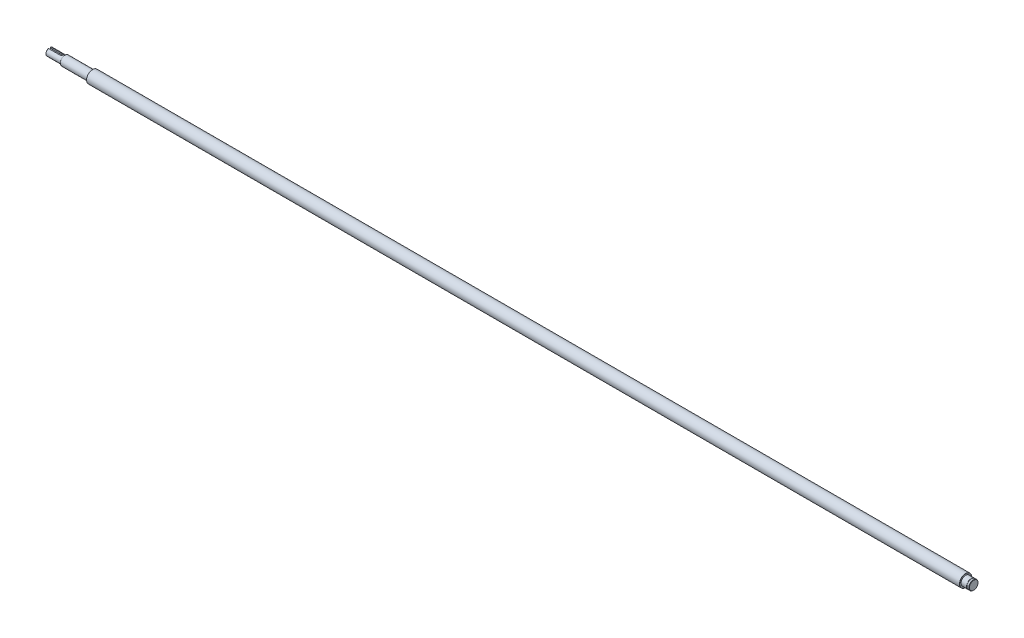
from build123d import *

# Parameters (mm, degrees)
CHAMFER1_SIZE      = 0.5
CHAMFER2_SIZE      = 0.2
CUT_EXTRUDE1_DEPTH = 4


with BuildPart() as part:
    # Sketch1 → Revolve1 (revolve)
    with BuildSketch(Plane.XY, mode=Mode.PRIVATE) as revolve1_sk:
        Polygon((0, 0), (1500, 0), (1500, 7.5), (1497.15, 7.5), (1497.15, 7.15), (1496, 7.15), (1496, 7.5), (1487, 7.5), (1487, 9.9), (70, 9.9), (70, 7.5), (25, 7.5), (25, 6), (0, 6), align=None)
    revolve(revolve1_sk.sketch.rotate(Axis((0, 0, 0), (1, 0, 0)), 90), axis=Axis((0, 0, 0), (1, 0, 0)))

    # Chamfer1
    chamfer1_edges = [part.edges().sort_by_distance(p)[0] for p in [
        (1500, 0, -7.5),
        (0, 0, -6),
    ]]
    chamfer(chamfer1_edges, length=CHAMFER1_SIZE)

    # Chamfer2
    chamfer2_edges = [part.edges().sort_by_distance(p)[0] for p in [
        (1487, 0, -9.9),
        (70, 0, -9.9),
        (25, 0, -7.5),
    ]]
    chamfer(chamfer2_edges, length=CHAMFER2_SIZE)

    # Sketch4 → Cut-Extrude1 (cut)
    with BuildSketch(Plane(origin=(0, 3.5, 0), x_dir=(1, 0, 0), z_dir=(0, 1, 0))):
        with BuildLine():
            Line((0, -2), (0, 2))
            Line((0, 2), (20, 2))
            ThreePointArc((20, 2), (22, 0), (20, -2))
            Line((20, -2), (0, -2))
        make_face()
    extrude(amount=CUT_EXTRUDE1_DEPTH, mode=Mode.SUBTRACT)


solid = part.part
